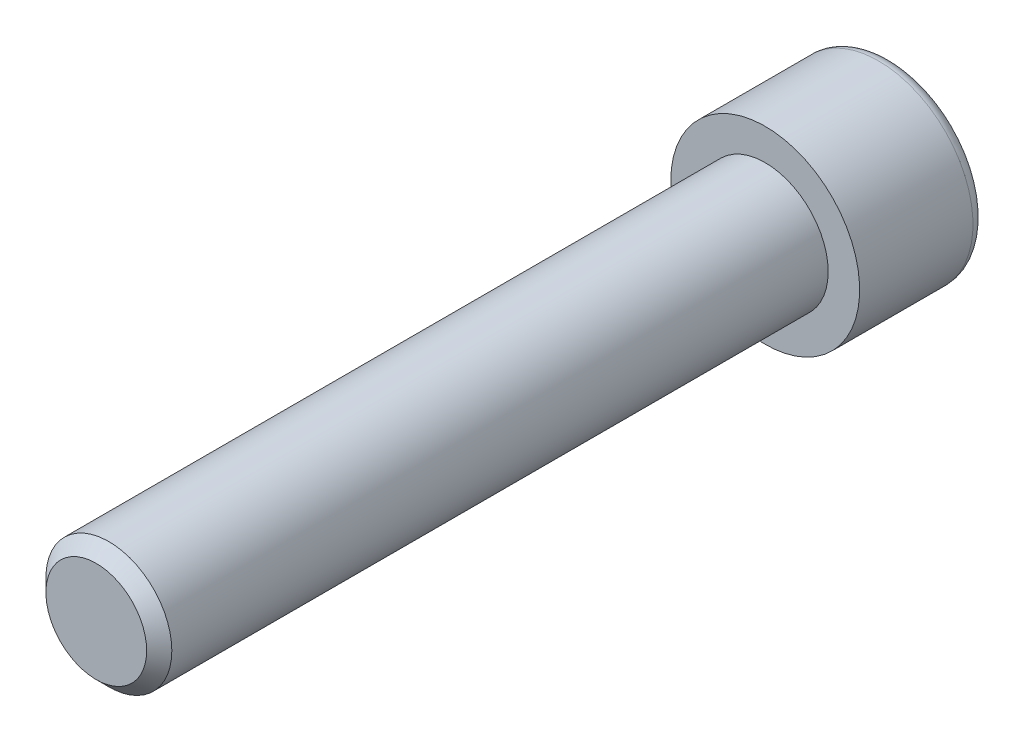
from build123d import *

# Parameters (mm, degrees)
ENLEV_MAT_EXTRU1_DEPTH = 8
ESQUISSE3_W            = 8
ESQUISSE3_H            = 85
CHANFREIN1_SIZE        = 1.6


with BuildPart() as part:
    # Esquisse1 → Base-R_volution (revolve)
    with BuildSketch(Plane(origin=(0, 0, 0), x_dir=(1, 0, 0), z_dir=(0, 1, 0)), mode=Mode.PRIVATE) as base_r_volution_sk:
        with BuildLine():
            Line((0, 0), (12, 0))
            Line((12, 0), (12, 14.4))
            ThreePointArc((12, 14.4), (11.53137085, 15.53137085), (10.4, 16))
            Line((10.4, 16), (0, 16))
            Line((0, 16), (0, 0))
        make_face()
    revolve(base_r_volution_sk.sketch.rotate(Axis((0, 0, 0), (0, 0, -1)), 180), axis=Axis((0, 0, 0), (0, 0, -1)))

    # Esquisse2 → enlev-mat-Extru1 (cut)
    with BuildSketch(Plane.XY.offset(-16)):
        Polygon((7, -4.041451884), (7, 4.041451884), (0, 8.082903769), (-7, 4.041451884), (-7, -4.041451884), (0, -8.082903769), align=None)
    extrude(amount=ENLEV_MAT_EXTRU1_DEPTH, mode=Mode.SUBTRACT)

    # Esquisse3 → Boss.-R_vol.1 (revolve)
    with BuildSketch(Plane(origin=(0, 0, 0), x_dir=(1, 0, 0), z_dir=(0, 1, 0))):
        with Locations((4, -42.5)):
            Rectangle(ESQUISSE3_W, ESQUISSE3_H)
    revolve(axis=Axis((0, 0, 0), (0, 0, 1)))

    # Chanfrein1
    chanfrein1_edges = [part.edges().sort_by_distance(p)[0] for p in [
        (-8, 0, 85),
    ]]
    chamfer(chanfrein1_edges, length=CHANFREIN1_SIZE)


solid = part.part
